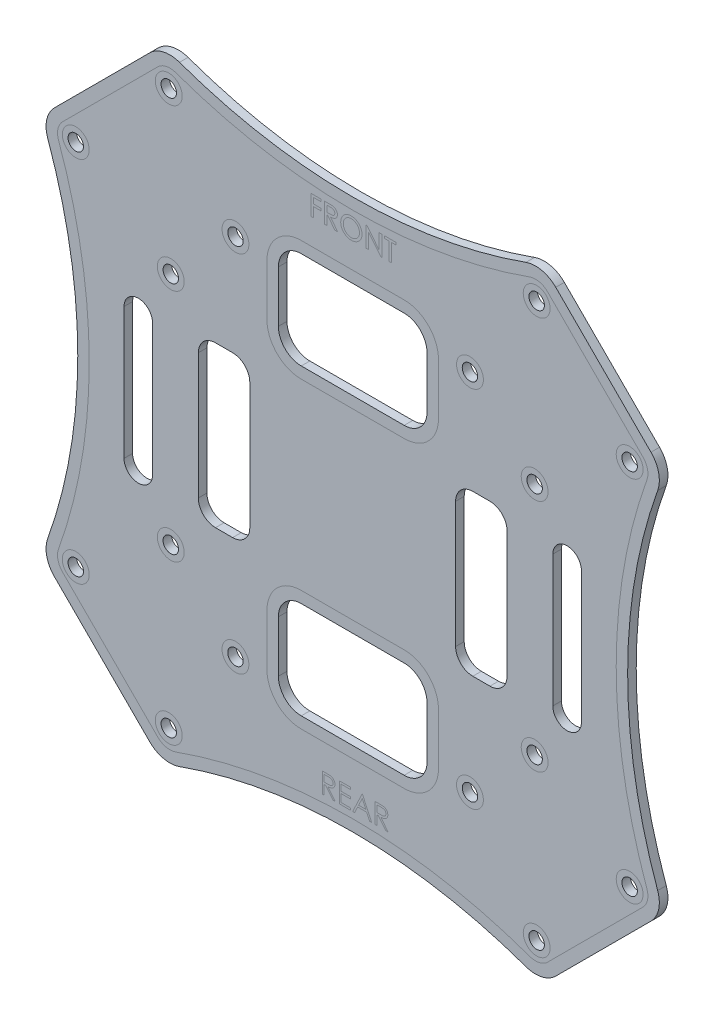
from build123d import *

# Parameters (mm, degrees)
PLAQUE_BRUTE_DEPTH   = 1.5
CONG_EXTERIEUR_R     = 5
TROU_DE_PLAQUE_DEPTH = 76.860071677
ESQUISSE3_R          = 1.35
PASSAGE_VIS_DEPTH    = 76.860071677


with BuildPart() as part:
    # Esquisse1 → plaque brute (new body)
    with BuildSketch(Plane.XY):
        with BuildLine():
            Line((33.234018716, 54.447222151), (54.447222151, 33.234018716))
            ThreePointArc((54.447222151, 33.234018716), (48.086327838, 0), (54.447222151, -33.234018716))
            Line((54.447222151, -33.234018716), (33.234018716, -54.447222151))
            ThreePointArc((33.234018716, -54.447222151), (0, -48.086327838), (-33.234018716, -54.447222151))
            Line((-33.234018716, -54.447222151), (-54.447222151, -33.234018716))
            ThreePointArc((-54.447222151, -33.234018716), (-48.086327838, 0), (-54.447222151, 33.234018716))
            Line((-54.447222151, 33.234018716), (-33.234018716, 54.447222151))
            ThreePointArc((-33.234018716, 54.447222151), (0, 48.086327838), (33.234018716, 54.447222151))
        make_face()
    extrude(amount=PLAQUE_BRUTE_DEPTH)

    # cong_ exterieur
    cong_exterieur_edges = [part.edges().sort_by_distance(p)[0] for p in [
        (33.234018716, 54.447222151, 0.75),
        (54.447222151, 33.234018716, 0.75),
        (54.447222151, -33.234018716, 0.75),
        (33.234018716, -54.447222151, 0.75),
        (-33.234018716, -54.447222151, 0.75),
        (-54.447222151, -33.234018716, 0.75),
        (-54.447222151, 33.234018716, 0.75),
        (-33.234018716, 54.447222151, 0.75),
    ]]
    fillet(cong_exterieur_edges, radius=CONG_EXTERIEUR_R)

    # Esquisse2 → trou de plaque (cut, through all)
    with BuildSketch(Plane.XY.offset(1.5)):
        with BuildLine():
            Line((-9, 35), (9, 35))
            ThreePointArc((9, 35), (11.828427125, 33.828427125), (13, 31))
            Line((13, 31), (13, 22))
            ThreePointArc((13, 22), (11.828427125, 19.171572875), (9, 18))
            Line((9, 18), (-9, 18))
            ThreePointArc((-9, 18), (-11.828427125, 19.171572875), (-13, 22))
            Line((-13, 22), (-13, 31))
            ThreePointArc((-13, 31), (-11.828427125, 33.828427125), (-9, 35))
        make_face()
        with BuildLine():
            Line((13, -31), (13, -22))
            ThreePointArc((13, -22), (11.828427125, -19.171572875), (9, -18))
            Line((9, -18), (-9, -18))
            ThreePointArc((-9, -18), (-11.828427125, -19.171572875), (-13, -22))
            Line((-13, -22), (-13, -31))
            ThreePointArc((-13, -31), (-11.828427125, -33.828427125), (-9, -35))
            Line((-9, -35), (9, -35))
            ThreePointArc((9, -35), (11.828427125, -33.828427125), (13, -31))
        make_face()
        with BuildLine():
            Line((-40, 11.5), (-40, -11.5))
            ThreePointArc((-40, -11.5), (-37.5, -14), (-35, -11.5))
            Line((-35, -11.5), (-35, 11.5))
            ThreePointArc((-35, 11.5), (-37.5, 14), (-40, 11.5))
        make_face()
        with BuildLine():
            Line((-21, -14), (-24, -14))
            ThreePointArc((-24, -14), (-26.121320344, -13.121320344), (-27, -11))
            Line((-27, -11), (-27, 11))
            ThreePointArc((-27, 11), (-26.121320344, 13.121320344), (-24, 14))
            Line((-24, 14), (-21, 14))
            ThreePointArc((-21, 14), (-18.878679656, 13.121320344), (-18, 11))
            Line((-18, 11), (-18, -11))
            ThreePointArc((-18, -11), (-18.878679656, -13.121320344), (-21, -14))
        make_face()
        with BuildLine():
            Line((27, -11), (27, 11))
            ThreePointArc((27, 11), (26.121320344, 13.121320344), (24, 14))
            Line((24, 14), (21, 14))
            ThreePointArc((21, 14), (18.878679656, 13.121320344), (18, 11))
            Line((18, 11), (18, -11))
            ThreePointArc((18, -11), (18.878679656, -13.121320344), (21, -14))
            Line((21, -14), (24, -14))
            ThreePointArc((24, -14), (26.121320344, -13.121320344), (27, -11))
        make_face()
        with BuildLine():
            Line((35, 11.5), (35, -11.5))
            ThreePointArc((35, -11.5), (37.5, -14), (40, -11.5))
            Line((40, -11.5), (40, 11.5))
            ThreePointArc((40, 11.5), (37.5, 14), (35, 11.5))
        make_face()
    extrude(amount=-TROU_DE_PLAQUE_DEPTH, mode=Mode.SUBTRACT)

    # Esquisse3 → passage vis (cut, through all)
    with BuildSketch(Plane.XY.offset(1.5)):
        with Locations((-48.436814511, 32.173358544)):
            Circle(ESQUISSE3_R)
        with Locations((-32.173358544, 48.436814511)):
            Circle(ESQUISSE3_R)
        with Locations((-31.819805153, 20.506096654)):
            Circle(ESQUISSE3_R)
        with Locations((-20.506096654, 31.819805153)):
            Circle(ESQUISSE3_R)
        with Locations(Location((-20.506096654, -31.819805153, 0), (0, 0, 180))):
            Circle(ESQUISSE3_R)
        with Locations(Location((-31.819805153, -20.506096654, 0), (0, 0, 180))):
            Circle(ESQUISSE3_R)
        with Locations(Location((-32.173358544, -48.436814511, 0), (0, 0, 180))):
            Circle(ESQUISSE3_R)
        with Locations(Location((-48.436814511, -32.173358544, 0), (0, 0, 180))):
            Circle(ESQUISSE3_R)
        with Locations((48.436814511, -32.173358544)):
            Circle(ESQUISSE3_R)
        with Locations((32.173358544, -48.436814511)):
            Circle(ESQUISSE3_R)
        with Locations((31.819805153, -20.506096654)):
            Circle(ESQUISSE3_R)
        with Locations((20.506096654, -31.819805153)):
            Circle(ESQUISSE3_R)
        with Locations(Location((20.506096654, 31.819805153, 0), (0, 0, 180))):
            Circle(ESQUISSE3_R)
        with Locations(Location((31.819805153, 20.506096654, 0), (0, 0, 180))):
            Circle(ESQUISSE3_R)
        with Locations(Location((32.173358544, 48.436814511, 0), (0, 0, 180))):
            Circle(ESQUISSE3_R)
        with Locations(Location((48.436814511, 32.173358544, 0), (0, 0, 180))):
            Circle(ESQUISSE3_R)
    extrude(amount=-PASSAGE_VIS_DEPTH, mode=Mode.SUBTRACT)


solid = part.part
